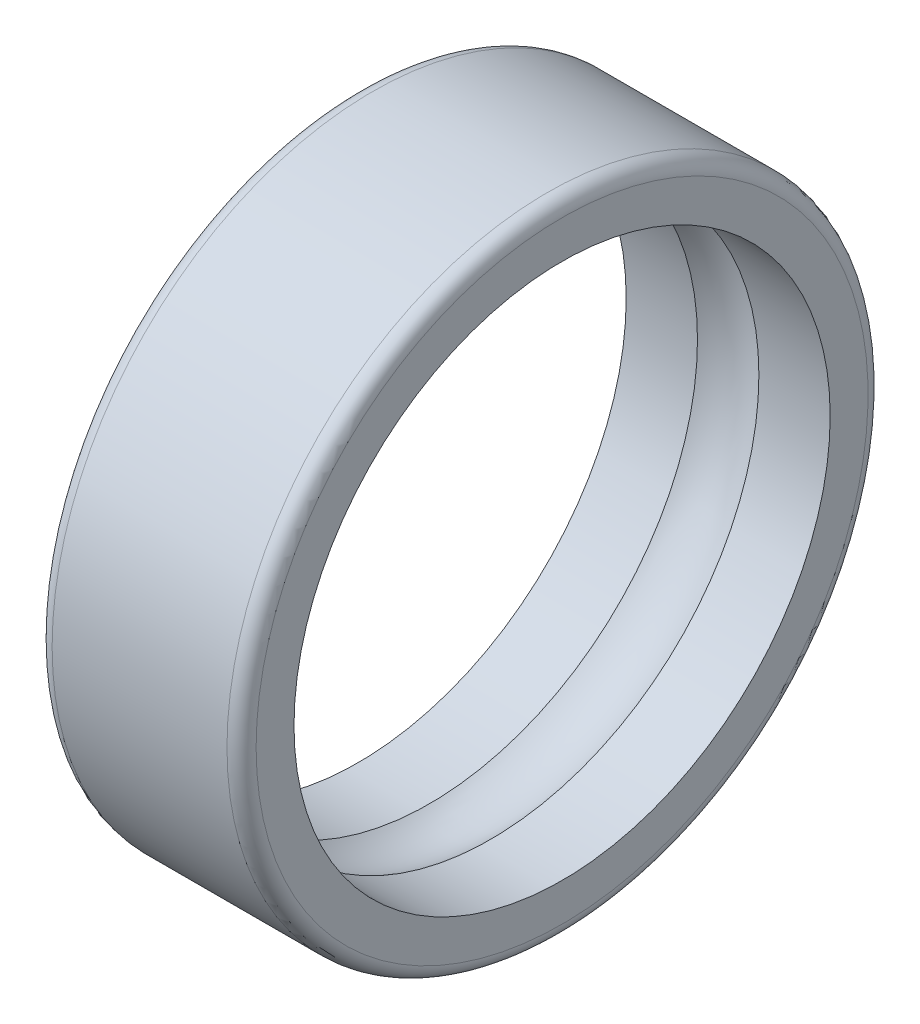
ISO-10303-21;
HEADER;
FILE_DESCRIPTION(('STEP AP214'),'2;1');
FILE_NAME('part.step','',(''),(''),'','','');
FILE_SCHEMA(('AUTOMOTIVE_DESIGN { 1 0 10303 214 1 1 1 1 }'));
ENDSEC;
DATA;
#1=APPLICATION_CONTEXT('core data for automotive mechanical design processes');
#2=APPLICATION_PROTOCOL_DEFINITION('international standard','automotive_design',2000,#1);
#3=PRODUCT_CONTEXT('',#1,'mechanical');
#4=PRODUCT('Part','Part','',(#3));
#5=PRODUCT_RELATED_PRODUCT_CATEGORY('part','',(#4));
#6=PRODUCT_DEFINITION_FORMATION('','',#4);
#7=PRODUCT_DEFINITION_CONTEXT('part definition',#1,'design');
#8=PRODUCT_DEFINITION('design','',#6,#7);
#9=PRODUCT_DEFINITION_SHAPE('','',#8);
#10=(LENGTH_UNIT() NAMED_UNIT(*) SI_UNIT(.MILLI.,.METRE.));
#11=(NAMED_UNIT(*) PLANE_ANGLE_UNIT() SI_UNIT($,.RADIAN.));
#12=(NAMED_UNIT(*) SI_UNIT($,.STERADIAN.) SOLID_ANGLE_UNIT());
#13=UNCERTAINTY_MEASURE_WITH_UNIT(LENGTH_MEASURE(1.E-05),#10,'distance_accuracy_value','');
#14=(GEOMETRIC_REPRESENTATION_CONTEXT(3) GLOBAL_UNCERTAINTY_ASSIGNED_CONTEXT((#13)) GLOBAL_UNIT_ASSIGNED_CONTEXT((#10,
#11,#12)) REPRESENTATION_CONTEXT('',''));
#15=CARTESIAN_POINT('',(0.,0.,0.));
#16=DIRECTION('',(0.,0.,1.));
#17=DIRECTION('',(1.,0.,0.));
#18=AXIS2_PLACEMENT_3D('',#15,#16,#17);
#19=CARTESIAN_POINT('',(3.,0.,0.));
#20=DIRECTION('',(-1.,0.,0.));
#21=DIRECTION('',(0.,0.,1.));
#22=AXIS2_PLACEMENT_3D('',#19,#20,#21);
#23=TOROIDAL_SURFACE('',#22,10.5,0.5);
#24=CARTESIAN_POINT('',(3.,0.,0.));
#25=DIRECTION('',(-1.,0.,0.));
#26=DIRECTION('',(0.,0.,1.));
#27=AXIS2_PLACEMENT_3D('',#24,#25,#26);
#28=CIRCLE('',#27,11.);
#29=CARTESIAN_POINT('',(3.,0.,11.));
#30=VERTEX_POINT('',#29);
#31=EDGE_CURVE('E60',#30,#30,#28,.T.);
#32=ORIENTED_EDGE('',*,*,#31,.F.);
#33=EDGE_LOOP('',(#32));
#34=FACE_BOUND('',#33,.T.);
#35=CARTESIAN_POINT('',(3.5,0.,0.));
#36=DIRECTION('',(-1.,0.,0.));
#37=DIRECTION('',(0.,0.,1.));
#38=AXIS2_PLACEMENT_3D('',#35,#36,#37);
#39=CIRCLE('',#38,10.5);
#40=CARTESIAN_POINT('',(3.5,0.,10.5));
#41=VERTEX_POINT('',#40);
#42=EDGE_CURVE('E10',#41,#41,#39,.T.);
#43=ORIENTED_EDGE('',*,*,#42,.T.);
#44=EDGE_LOOP('',(#43));
#45=FACE_BOUND('',#44,.T.);
#46=ADVANCED_FACE('F32',(#34,#45),#23,.T.);
#47=CARTESIAN_POINT('',(3.5,10.5,0.));
#48=DIRECTION('',(-1.,0.,0.));
#49=DIRECTION('',(0.,0.,1.));
#50=AXIS2_PLACEMENT_3D('',#47,#48,#49);
#51=PLANE('',#50);
#52=ORIENTED_EDGE('',*,*,#42,.F.);
#53=EDGE_LOOP('',(#52));
#54=FACE_BOUND('',#53,.T.);
#55=CARTESIAN_POINT('',(3.5,0.,0.));
#56=DIRECTION('',(-1.,0.,0.));
#57=DIRECTION('',(0.,0.,1.));
#58=AXIS2_PLACEMENT_3D('',#55,#56,#57);
#59=CIRCLE('',#58,9.2);
#60=CARTESIAN_POINT('',(3.5,0.,9.2));
#61=VERTEX_POINT('',#60);
#62=EDGE_CURVE('E38',#61,#61,#59,.T.);
#63=ORIENTED_EDGE('',*,*,#62,.T.);
#64=EDGE_LOOP('',(#63));
#65=FACE_BOUND('',#64,.T.);
#66=ADVANCED_FACE('F67',(#54,#65),#51,.F.);
#67=CARTESIAN_POINT('',(-4.37090809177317,0.,0.));
#68=DIRECTION('',(-1.,0.,0.));
#69=DIRECTION('',(0.,0.,1.));
#70=AXIS2_PLACEMENT_3D('',#67,#68,#69);
#71=CYLINDRICAL_SURFACE('',#70,9.2);
#72=ORIENTED_EDGE('',*,*,#62,.F.);
#73=EDGE_LOOP('',(#72));
#74=FACE_BOUND('',#73,.T.);
#75=CARTESIAN_POINT('',(1.05356537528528,0.,0.));
#76=DIRECTION('',(-1.,0.,0.));
#77=DIRECTION('',(0.,0.,1.));
#78=AXIS2_PLACEMENT_3D('',#75,#76,#77);
#79=CIRCLE('',#78,9.2);
#80=CARTESIAN_POINT('',(1.05356537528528,0.,9.2));
#81=VERTEX_POINT('',#80);
#82=EDGE_CURVE('E42',#81,#81,#79,.T.);
#83=ORIENTED_EDGE('',*,*,#82,.T.);
#84=EDGE_LOOP('',(#83));
#85=FACE_BOUND('',#84,.T.);
#86=ADVANCED_FACE('F71',(#74,#85),#71,.F.);
#87=CARTESIAN_POINT('',(0.,0.,0.));
#88=DIRECTION('',(-1.,0.,0.));
#89=DIRECTION('',(0.,0.,1.));
#90=AXIS2_PLACEMENT_3D('',#87,#88,#89);
#91=TOROIDAL_SURFACE('',#90,7.5,2.);
#92=ORIENTED_EDGE('',*,*,#82,.F.);
#93=EDGE_LOOP('',(#92));
#94=FACE_BOUND('',#93,.T.);
#95=CARTESIAN_POINT('',(-1.05356537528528,0.,0.));
#96=DIRECTION('',(-1.,0.,0.));
#97=DIRECTION('',(0.,0.,1.));
#98=AXIS2_PLACEMENT_3D('',#95,#96,#97);
#99=CIRCLE('',#98,9.2);
#100=CARTESIAN_POINT('',(-1.05356537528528,0.,9.2));
#101=VERTEX_POINT('',#100);
#102=EDGE_CURVE('E46',#101,#101,#99,.T.);
#103=ORIENTED_EDGE('',*,*,#102,.T.);
#104=EDGE_LOOP('',(#103));
#105=FACE_BOUND('',#104,.T.);
#106=ADVANCED_FACE('F76',(#94,#105),#91,.F.);
#107=CARTESIAN_POINT('',(-4.37090809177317,0.,0.));
#108=DIRECTION('',(-1.,0.,0.));
#109=DIRECTION('',(0.,0.,1.));
#110=AXIS2_PLACEMENT_3D('',#107,#108,#109);
#111=CYLINDRICAL_SURFACE('',#110,9.2);
#112=ORIENTED_EDGE('',*,*,#102,.F.);
#113=EDGE_LOOP('',(#112));
#114=FACE_BOUND('',#113,.T.);
#115=CARTESIAN_POINT('',(-3.5,0.,0.));
#116=DIRECTION('',(-1.,0.,0.));
#117=DIRECTION('',(0.,0.,1.));
#118=AXIS2_PLACEMENT_3D('',#115,#116,#117);
#119=CIRCLE('',#118,9.2);
#120=CARTESIAN_POINT('',(-3.5,0.,9.2));
#121=VERTEX_POINT('',#120);
#122=EDGE_CURVE('E51',#121,#121,#119,.T.);
#123=ORIENTED_EDGE('',*,*,#122,.T.);
#124=EDGE_LOOP('',(#123));
#125=FACE_BOUND('',#124,.T.);
#126=ADVANCED_FACE('F82',(#114,#125),#111,.F.);
#127=CARTESIAN_POINT('',(-3.5,10.5,0.));
#128=DIRECTION('',(1.,0.,0.));
#129=DIRECTION('',(0.,0.,-1.));
#130=AXIS2_PLACEMENT_3D('',#127,#128,#129);
#131=PLANE('',#130);
#132=ORIENTED_EDGE('',*,*,#122,.F.);
#133=EDGE_LOOP('',(#132));
#134=FACE_BOUND('',#133,.T.);
#135=CARTESIAN_POINT('',(-3.5,0.,0.));
#136=DIRECTION('',(-1.,0.,0.));
#137=DIRECTION('',(0.,0.,1.));
#138=AXIS2_PLACEMENT_3D('',#135,#136,#137);
#139=CIRCLE('',#138,10.5);
#140=CARTESIAN_POINT('',(-3.5,0.,10.5));
#141=VERTEX_POINT('',#140);
#142=EDGE_CURVE('E54',#141,#141,#139,.T.);
#143=ORIENTED_EDGE('',*,*,#142,.T.);
#144=EDGE_LOOP('',(#143));
#145=FACE_BOUND('',#144,.T.);
#146=ADVANCED_FACE('F86',(#134,#145),#131,.F.);
#147=CARTESIAN_POINT('',(-3.,0.,0.));
#148=DIRECTION('',(-1.,0.,0.));
#149=DIRECTION('',(0.,0.,1.));
#150=AXIS2_PLACEMENT_3D('',#147,#148,#149);
#151=TOROIDAL_SURFACE('',#150,10.5,0.5);
#152=ORIENTED_EDGE('',*,*,#142,.F.);
#153=EDGE_LOOP('',(#152));
#154=FACE_BOUND('',#153,.T.);
#155=CARTESIAN_POINT('',(-3.,0.,0.));
#156=DIRECTION('',(-1.,0.,0.));
#157=DIRECTION('',(0.,0.,1.));
#158=AXIS2_PLACEMENT_3D('',#155,#156,#157);
#159=CIRCLE('',#158,11.);
#160=CARTESIAN_POINT('',(-3.,0.,11.));
#161=VERTEX_POINT('',#160);
#162=EDGE_CURVE('E57',#161,#161,#159,.T.);
#163=ORIENTED_EDGE('',*,*,#162,.T.);
#164=EDGE_LOOP('',(#163));
#165=FACE_BOUND('',#164,.T.);
#166=ADVANCED_FACE('F90',(#154,#165),#151,.T.);
#167=CARTESIAN_POINT('',(-4.37090809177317,0.,0.));
#168=DIRECTION('',(-1.,0.,0.));
#169=DIRECTION('',(0.,0.,1.));
#170=AXIS2_PLACEMENT_3D('',#167,#168,#169);
#171=CYLINDRICAL_SURFACE('',#170,11.);
#172=ORIENTED_EDGE('',*,*,#162,.F.);
#173=EDGE_LOOP('',(#172));
#174=FACE_BOUND('',#173,.T.);
#175=ORIENTED_EDGE('',*,*,#31,.T.);
#176=EDGE_LOOP('',(#175));
#177=FACE_BOUND('',#176,.T.);
#178=ADVANCED_FACE('F64',(#174,#177),#171,.T.);
#179=CLOSED_SHELL('',(#46,#66,#86,#106,#126,#146,#166,#178));
#180=MANIFOLD_SOLID_BREP('B2',#179);
#181=ADVANCED_BREP_SHAPE_REPRESENTATION('',(#18,#180),#14);
#182=SHAPE_DEFINITION_REPRESENTATION(#9,#181);
ENDSEC;
END-ISO-10303-21;
